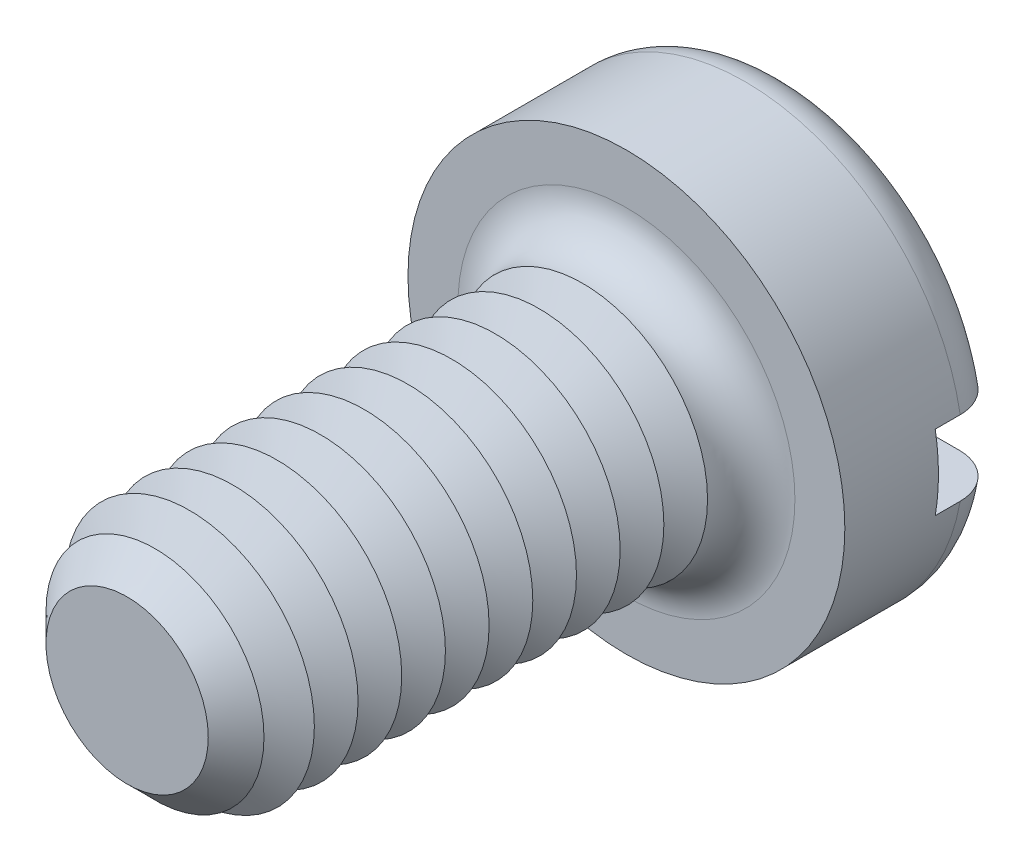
ISO-10303-21;
HEADER;
FILE_DESCRIPTION(('STEP AP214'),'2;1');
FILE_NAME('part.step','',(''),(''),'','','');
FILE_SCHEMA(('AUTOMOTIVE_DESIGN { 1 0 10303 214 1 1 1 1 }'));
ENDSEC;
DATA;
#1=APPLICATION_CONTEXT('core data for automotive mechanical design processes');
#2=APPLICATION_PROTOCOL_DEFINITION('international standard','automotive_design',2000,#1);
#3=PRODUCT_CONTEXT('',#1,'mechanical');
#4=PRODUCT('Part','Part','',(#3));
#5=PRODUCT_RELATED_PRODUCT_CATEGORY('part','',(#4));
#6=PRODUCT_DEFINITION_FORMATION('','',#4);
#7=PRODUCT_DEFINITION_CONTEXT('part definition',#1,'design');
#8=PRODUCT_DEFINITION('design','',#6,#7);
#9=PRODUCT_DEFINITION_SHAPE('','',#8);
#10=(LENGTH_UNIT() NAMED_UNIT(*) SI_UNIT(.MILLI.,.METRE.));
#11=(NAMED_UNIT(*) PLANE_ANGLE_UNIT() SI_UNIT($,.RADIAN.));
#12=(NAMED_UNIT(*) SI_UNIT($,.STERADIAN.) SOLID_ANGLE_UNIT());
#13=UNCERTAINTY_MEASURE_WITH_UNIT(LENGTH_MEASURE(1.E-05),#10,'distance_accuracy_value','');
#14=(GEOMETRIC_REPRESENTATION_CONTEXT(3) GLOBAL_UNCERTAINTY_ASSIGNED_CONTEXT((#13)) GLOBAL_UNIT_ASSIGNED_CONTEXT((#10,
#11,#12)) REPRESENTATION_CONTEXT('',''));
#15=CARTESIAN_POINT('',(0.,0.,0.));
#16=DIRECTION('',(0.,0.,1.));
#17=DIRECTION('',(1.,0.,0.));
#18=AXIS2_PLACEMENT_3D('',#15,#16,#17);
#19=CARTESIAN_POINT('',(0.,0.,-2.6));
#20=DIRECTION('',(0.,0.,1.));
#21=DIRECTION('',(1.,0.,0.));
#22=AXIS2_PLACEMENT_3D('',#19,#20,#21);
#23=PLANE('',#22);
#24=CARTESIAN_POINT('',(0.,0.,-2.6));
#25=DIRECTION('',(0.,0.,1.));
#26=DIRECTION('',(1.,0.,0.));
#27=AXIS2_PLACEMENT_3D('',#24,#25,#26);
#28=CIRCLE('',#27,2.8);
#29=CARTESIAN_POINT('',(-2.73495886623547,0.6,-2.6));
#30=VERTEX_POINT('',#29);
#31=CARTESIAN_POINT('',(2.73495886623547,0.6,-2.6));
#32=VERTEX_POINT('',#31);
#33=EDGE_CURVE('E116',#30,#32,#28,.F.);
#34=ORIENTED_EDGE('',*,*,#33,.T.);
#35=DIRECTION('',(1.,0.,0.));
#36=VECTOR('',#35,1.);
#37=CARTESIAN_POINT('',(-3.5,0.600000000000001,-2.6));
#38=LINE('',#37,#36);
#39=EDGE_CURVE('E111',#30,#32,#38,.T.);
#40=ORIENTED_EDGE('',*,*,#39,.F.);
#41=EDGE_LOOP('',(#34,#40));
#42=FACE_BOUND('',#41,.T.);
#43=ADVANCED_FACE('F39',(#42),#23,.F.);
#44=CARTESIAN_POINT('',(0.,0.,-1.9));
#45=DIRECTION('',(0.,0.,1.));
#46=DIRECTION('',(1.,0.,0.));
#47=AXIS2_PLACEMENT_3D('',#44,#45,#46);
#48=TOROIDAL_SURFACE('',#47,2.8,0.7);
#49=CARTESIAN_POINT('',(-3.24550494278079,0.600000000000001,-2.38938679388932));
#50=CARTESIAN_POINT('',(-3.21724139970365,0.600000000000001,-2.41780774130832));
#51=CARTESIAN_POINT('',(-3.18652103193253,0.600000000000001,-2.44383169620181));
#52=CARTESIAN_POINT('',(-3.12110229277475,0.600000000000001,-2.49034599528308));
#53=CARTESIAN_POINT('',(-3.08639834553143,0.6,-2.51082844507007));
#54=CARTESIAN_POINT('',(-3.01410013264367,0.6,-2.54568075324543));
#55=CARTESIAN_POINT('',(-2.97650963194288,0.6,-2.56005841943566));
#56=CARTESIAN_POINT('',(-2.89948250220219,0.6,-2.58239238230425));
#57=CARTESIAN_POINT('',(-2.86004633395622,0.6,-2.59035027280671));
#58=CARTESIAN_POINT('',(-2.77983715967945,0.6,-2.5997577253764));
#59=CARTESIAN_POINT('',(-2.73905311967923,0.6,-2.60111317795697));
#60=CARTESIAN_POINT('',(-2.65781876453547,0.6,-2.59706866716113));
#61=CARTESIAN_POINT('',(-2.61736849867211,0.6,-2.59166772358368));
#62=CARTESIAN_POINT('',(-2.53729983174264,0.6,-2.57414594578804));
#63=CARTESIAN_POINT('',(-2.49770360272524,0.6,-2.56192363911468));
#64=CARTESIAN_POINT('',(-2.421111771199,0.6,-2.5310238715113));
#65=CARTESIAN_POINT('',(-2.38411632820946,0.6,-2.51234601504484));
#66=CARTESIAN_POINT('',(-2.31371213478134,0.6,-2.46896762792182));
#67=CARTESIAN_POINT('',(-2.28031240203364,0.6,-2.44425244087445));
#68=CARTESIAN_POINT('',(-2.21823311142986,0.6,-2.38946667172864));
#69=CARTESIAN_POINT('',(-2.18955321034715,0.6,-2.35939647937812));
#70=CARTESIAN_POINT('',(-2.13836074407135,0.6,-2.29532787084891));
#71=CARTESIAN_POINT('',(-2.11574147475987,0.6,-2.26141482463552));
#72=CARTESIAN_POINT('',(-2.07677080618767,0.6,-2.19015935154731));
#73=CARTESIAN_POINT('',(-2.06041784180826,0.6,-2.15281778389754));
#74=CARTESIAN_POINT('',(-2.03508596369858,0.6,-2.07723332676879));
#75=CARTESIAN_POINT('',(-2.02585871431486,0.6,-2.03907365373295));
#76=CARTESIAN_POINT('',(-2.01416722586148,0.6,-1.96173417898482));
#77=CARTESIAN_POINT('',(-2.01170151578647,0.6,-1.92255460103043));
#78=CARTESIAN_POINT('',(-2.01359934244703,0.6,-1.84555709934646));
#79=CARTESIAN_POINT('',(-2.01775787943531,0.6,-1.80773393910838));
#80=CARTESIAN_POINT('',(-2.03236373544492,0.6,-1.73332511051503));
#81=CARTESIAN_POINT('',(-2.04281097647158,0.6,-1.69673942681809));
#82=CARTESIAN_POINT('',(-2.06962963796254,0.6,-1.62577336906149));
#83=CARTESIAN_POINT('',(-2.08600685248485,0.6,-1.59139519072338));
#84=CARTESIAN_POINT('',(-2.12413495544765,0.6,-1.52576356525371));
#85=CARTESIAN_POINT('',(-2.14588657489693,0.6,-1.49451054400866));
#86=CARTESIAN_POINT('',(-2.19483541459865,0.6,-1.43498643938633));
#87=CARTESIAN_POINT('',(-2.22217844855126,0.6,-1.40683532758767));
#88=CARTESIAN_POINT('',(-2.28105616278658,0.6,-1.35532544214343));
#89=CARTESIAN_POINT('',(-2.3125916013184,0.6,-1.33196753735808));
#90=CARTESIAN_POINT('',(-2.38018779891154,0.6,-1.28984356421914));
#91=CARTESIAN_POINT('',(-2.41637068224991,0.6,-1.27127330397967));
#92=CARTESIAN_POINT('',(-2.49129688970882,0.6,-1.24032971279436));
#93=CARTESIAN_POINT('',(-2.53004053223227,0.6,-1.22795715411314));
#94=CARTESIAN_POINT('',(-2.6098393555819,0.6,-1.2095515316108));
#95=CARTESIAN_POINT('',(-2.65092550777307,0.6,-1.20365237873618));
#96=CARTESIAN_POINT('',(-2.7335069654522,0.6,-1.1988380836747));
#97=CARTESIAN_POINT('',(-2.7750022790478,0.6,-1.19992308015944));
#98=CARTESIAN_POINT('',(-2.85718851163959,0.6,-1.20909046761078));
#99=CARTESIAN_POINT('',(-2.8978799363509,0.6,-1.21716830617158));
#100=CARTESIAN_POINT('',(-2.97729176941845,0.6,-1.24014327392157));
#101=CARTESIAN_POINT('',(-3.01601231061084,0.6,-1.25503994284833));
#102=CARTESIAN_POINT('',(-3.08976822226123,0.6,-1.29101066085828));
#103=CARTESIAN_POINT('',(-3.12484927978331,0.600000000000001,-1.31199098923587));
#104=CARTESIAN_POINT('',(-3.19090022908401,0.600000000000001,-1.35965144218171));
#105=CARTESIAN_POINT('',(-3.22187053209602,0.600000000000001,-1.38633099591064));
#106=CARTESIAN_POINT('',(-3.2781946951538,0.600000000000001,-1.44408564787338));
#107=CARTESIAN_POINT('',(-3.3036441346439,0.600000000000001,-1.47506754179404));
#108=CARTESIAN_POINT('',(-3.34887649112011,0.600000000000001,-1.54092398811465));
#109=CARTESIAN_POINT('',(-3.36865993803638,0.600000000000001,-1.57579817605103));
#110=CARTESIAN_POINT('',(-3.40166738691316,0.600000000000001,-1.64783067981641));
#111=CARTESIAN_POINT('',(-3.41499360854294,0.600000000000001,-1.68494217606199));
#112=CARTESIAN_POINT('',(-3.43515375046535,0.600000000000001,-1.76088675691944));
#113=CARTESIAN_POINT('',(-3.44198836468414,0.600000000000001,-1.79971965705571));
#114=CARTESIAN_POINT('',(-3.44891916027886,0.600000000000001,-1.87757893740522));
#115=CARTESIAN_POINT('',(-3.44908375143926,0.600000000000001,-1.91659924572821));
#116=CARTESIAN_POINT('',(-3.44284111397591,0.600000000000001,-1.99412088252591));
#117=CARTESIAN_POINT('',(-3.43643236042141,0.600000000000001,-2.03262208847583));
#118=CARTESIAN_POINT('',(-3.41725803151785,0.600000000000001,-2.10792315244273));
#119=CARTESIAN_POINT('',(-3.40450469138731,0.600000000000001,-2.14472613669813));
#120=CARTESIAN_POINT('',(-3.3730385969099,0.600000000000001,-2.21565060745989));
#121=CARTESIAN_POINT('',(-3.35433321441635,0.600000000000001,-2.24977534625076));
#122=CARTESIAN_POINT('',(-3.3201892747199,0.600000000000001,-2.30136364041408));
#123=CARTESIAN_POINT('',(-3.30647805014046,0.600000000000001,-2.31999402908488));
#124=CARTESIAN_POINT('',(-3.27728518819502,0.600000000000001,-2.35581090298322));
#125=CARTESIAN_POINT('',(-3.26180356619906,0.600000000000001,-2.37299740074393));
#126=CARTESIAN_POINT('',(-3.24550494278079,0.600000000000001,-2.38938679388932));
#127=B_SPLINE_CURVE_WITH_KNOTS('',3,(#49,#50,#51,#52,#53,#54,#55,#56,#57,#58,#59,#60,#61,#62,
#63,#64,#65,#66,#67,#68,#69,#70,#71,#72,#73,#74,#75,#76,#77,#78,#79,#80,#81,#82,#83,#84,#85,#86,
#87,#88,#89,#90,#91,#92,#93,#94,#95,#96,#97,#98,#99,#100,#101,#102,#103,#104,#105,#106,#107,
#108,#109,#110,#111,#112,#113,#114,#115,#116,#117,#118,#119,#120,#121,#122,#123,#124,#125,#126),
.UNSPECIFIED.,.T.,.F.,(4,2,2,2,2,2,2,2,2,2,2,2,2,2,2,2,2,2,2,2,2,2,2,2,2,2,2,2,2,2,2,2,2,2,2,2,
2,2,4),(0.,0.120160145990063,0.240490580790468,0.36066665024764,0.480812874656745,
0.602666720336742,0.724538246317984,0.848272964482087,0.972015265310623,1.09606100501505,
1.2200977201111,1.34178071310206,1.46343329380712,1.58062647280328,1.6977941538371,
1.81140573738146,1.92501591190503,2.03873739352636,2.15247435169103,2.26967910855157,
2.38690509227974,2.50835551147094,2.62982106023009,2.75375450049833,2.87769040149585,
3.00154567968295,3.12539259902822,3.24742469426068,3.36944457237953,3.48914477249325,
3.60883377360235,3.72656056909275,3.84427477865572,3.96078136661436,4.07731498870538,
4.19362474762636,4.3097910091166,4.37908387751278,4.44837614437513),.UNSPECIFIED.);
#128=CARTESIAN_POINT('',(-3.44818792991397,0.600000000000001,-1.8999999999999));
#129=VERTEX_POINT('',#128);
#130=EDGE_CURVE('E265',#129,#30,#127,.T.);
#131=ORIENTED_EDGE('',*,*,#130,.F.);
#132=CARTESIAN_POINT('',(0.,0.,-1.9));
#133=DIRECTION('',(0.,0.,1.));
#134=DIRECTION('',(1.,0.,0.));
#135=AXIS2_PLACEMENT_3D('',#132,#133,#134);
#136=CIRCLE('',#135,3.5);
#137=CARTESIAN_POINT('',(3.44818792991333,0.6,-1.9));
#138=VERTEX_POINT('',#137);
#139=EDGE_CURVE('E125',#138,#129,#136,.T.);
#140=ORIENTED_EDGE('',*,*,#139,.F.);
#141=CARTESIAN_POINT('',(2.1414268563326,0.6,-2.29762171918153));
#142=CARTESIAN_POINT('',(2.16505443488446,0.6,-2.33058245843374));
#143=CARTESIAN_POINT('',(2.19155609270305,0.6,-2.36152717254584));
#144=CARTESIAN_POINT('',(2.24942944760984,0.6,-2.41852964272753));
#145=CARTESIAN_POINT('',(2.28080921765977,0.6,-2.44457913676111));
#146=CARTESIAN_POINT('',(2.34741203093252,0.6,-2.49105381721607));
#147=CARTESIAN_POINT('',(2.38262862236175,0.6,-2.51148824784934));
#148=CARTESIAN_POINT('',(2.45593176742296,0.6,-2.54626881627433));
#149=CARTESIAN_POINT('',(2.49401741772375,0.6,-2.56061686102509));
#150=CARTESIAN_POINT('',(2.57272605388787,0.6,-2.58306429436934));
#151=CARTESIAN_POINT('',(2.6133821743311,0.6,-2.59104769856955));
#152=CARTESIAN_POINT('',(2.6954618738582,0.6,-2.60009608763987));
#153=CARTESIAN_POINT('',(2.73688552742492,0.6,-2.60116039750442));
#154=CARTESIAN_POINT('',(2.81941950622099,0.6,-2.5962925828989));
#155=CARTESIAN_POINT('',(2.86052888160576,0.6,-2.59034422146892));
#156=CARTESIAN_POINT('',(2.94113709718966,0.6,-2.57153687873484));
#157=CARTESIAN_POINT('',(2.98063603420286,0.6,-2.55867831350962));
#158=CARTESIAN_POINT('',(3.05633735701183,0.6,-2.52657771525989));
#159=CARTESIAN_POINT('',(3.09257627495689,0.6,-2.50742188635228));
#160=CARTESIAN_POINT('',(3.16123898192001,0.6,-2.46318606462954));
#161=CARTESIAN_POINT('',(3.19366316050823,0.6,-2.4381066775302));
#162=CARTESIAN_POINT('',(3.25312278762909,0.6,-2.38324481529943));
#163=CARTESIAN_POINT('',(3.28024842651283,0.6,-2.35356008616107));
#164=CARTESIAN_POINT('',(3.32902587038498,0.6,-2.28998971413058));
#165=CARTESIAN_POINT('',(3.35067820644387,0.6,-2.25610447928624));
#166=CARTESIAN_POINT('',(3.38751207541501,0.6,-2.18572286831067));
#167=CARTESIAN_POINT('',(3.40279804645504,0.6,-2.14928112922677));
#168=CARTESIAN_POINT('',(3.42695590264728,0.6,-2.07433042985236));
#169=CARTESIAN_POINT('',(3.43582824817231,0.6,-2.03582161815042));
#170=CARTESIAN_POINT('',(3.44682113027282,0.6,-1.95829536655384));
#171=CARTESIAN_POINT('',(3.44901648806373,0.6,-1.91928851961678));
#172=CARTESIAN_POINT('',(3.44680085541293,0.6,-1.84146366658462));
#173=CARTESIAN_POINT('',(3.44239008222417,0.6,-1.80264565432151));
#174=CARTESIAN_POINT('',(3.42712544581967,0.6,-1.72644634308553));
#175=CARTESIAN_POINT('',(3.41629508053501,0.6,-1.6890603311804));
#176=CARTESIAN_POINT('',(3.38853757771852,0.6,-1.61662604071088));
#177=CARTESIAN_POINT('',(3.37161039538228,0.6,-1.58157777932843));
#178=CARTESIAN_POINT('',(3.33207798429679,0.6,-1.51464178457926));
#179=CARTESIAN_POINT('',(3.30944854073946,0.6,-1.48276835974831));
#180=CARTESIAN_POINT('',(3.2592165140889,0.6,-1.42321861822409));
#181=CARTESIAN_POINT('',(3.23161370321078,0.6,-1.3955424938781));
#182=CARTESIAN_POINT('',(3.17188519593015,0.6,-1.34481834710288));
#183=CARTESIAN_POINT('',(3.13971065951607,0.6,-1.32182785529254));
#184=CARTESIAN_POINT('',(3.07201123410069,0.6,-1.28147003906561));
#185=CARTESIAN_POINT('',(3.03648608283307,0.6,-1.26410315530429));
#186=CARTESIAN_POINT('',(2.962449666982,0.6,-1.2351645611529));
#187=CARTESIAN_POINT('',(2.92389781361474,0.6,-1.22369671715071));
#188=CARTESIAN_POINT('',(2.84543273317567,0.6,-1.20726565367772));
#189=CARTESIAN_POINT('',(2.80551936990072,0.6,-1.20230308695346));
#190=CARTESIAN_POINT('',(2.72467191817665,0.6,-1.1989357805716));
#191=CARTESIAN_POINT('',(2.68373266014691,0.6,-1.20065484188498));
#192=CARTESIAN_POINT('',(2.60270222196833,0.6,-1.21084560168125));
#193=CARTESIAN_POINT('',(2.56261112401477,0.6,-1.21931795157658));
#194=CARTESIAN_POINT('',(2.48385954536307,0.6,-1.24292934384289));
#195=CARTESIAN_POINT('',(2.44522508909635,0.6,-1.25815531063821));
#196=CARTESIAN_POINT('',(2.37106165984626,0.6,-1.29488663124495));
#197=CARTESIAN_POINT('',(2.33553282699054,0.6,-1.31639226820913));
#198=CARTESIAN_POINT('',(2.2686996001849,0.6,-1.36507949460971));
#199=CARTESIAN_POINT('',(2.23738745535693,0.6,-1.39225042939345));
#200=CARTESIAN_POINT('',(2.17990424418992,0.6,-1.45157941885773));
#201=CARTESIAN_POINT('',(2.15373259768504,0.6,-1.48373691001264));
#202=CARTESIAN_POINT('',(2.10799355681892,0.6,-1.551327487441));
#203=CARTESIAN_POINT('',(2.08828258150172,0.6,-1.58666329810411));
#204=CARTESIAN_POINT('',(2.05534440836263,0.6,-1.66023600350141));
#205=CARTESIAN_POINT('',(2.042115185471,0.6,-1.6984719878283));
#206=CARTESIAN_POINT('',(2.02303126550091,0.6,-1.77519783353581));
#207=CARTESIAN_POINT('',(2.01691541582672,0.6,-1.8136228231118));
#208=CARTESIAN_POINT('',(2.01140375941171,0.6,-1.89096056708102));
#209=CARTESIAN_POINT('',(2.01200856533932,0.6,-1.92987336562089));
#210=CARTESIAN_POINT('',(2.01981617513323,0.6,-2.006065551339));
#211=CARTESIAN_POINT('',(2.02685835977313,0.6,-2.04336165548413));
#212=CARTESIAN_POINT('',(2.0470502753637,0.6,-2.1162250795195));
#213=CARTESIAN_POINT('',(2.06019252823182,0.6,-2.15179445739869));
#214=CARTESIAN_POINT('',(2.08525738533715,0.6,-2.20558874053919));
#215=CARTESIAN_POINT('',(2.09529161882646,0.6,-2.22471751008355));
#216=CARTESIAN_POINT('',(2.11708813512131,0.6,-2.26196179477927));
#217=CARTESIAN_POINT('',(2.12885034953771,0.6,-2.28007734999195));
#218=CARTESIAN_POINT('',(2.1414268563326,0.6,-2.29762171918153));
#219=B_SPLINE_CURVE_WITH_KNOTS('',3,(#141,#142,#143,#144,#145,#146,#147,#148,#149,#150,#151,
#152,#153,#154,#155,#156,#157,#158,#159,#160,#161,#162,#163,#164,#165,#166,#167,#168,#169,#170,
#171,#172,#173,#174,#175,#176,#177,#178,#179,#180,#181,#182,#183,#184,#185,#186,#187,#188,#189,
#190,#191,#192,#193,#194,#195,#196,#197,#198,#199,#200,#201,#202,#203,#204,#205,#206,#207,#208,
#209,#210,#211,#212,#213,#214,#215,#216,#217,#218),.UNSPECIFIED.,.T.,.F.,(4,2,2,2,2,2,2,2,2,2,2,
2,2,2,2,2,2,2,2,2,2,2,2,2,2,2,2,2,2,2,2,2,2,2,2,2,2,2,4),(0.,0.121582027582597,
0.243367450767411,0.364951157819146,0.486496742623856,0.610209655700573,0.733934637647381,
0.857946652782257,0.981951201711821,1.1043243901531,1.22668507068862,1.34673532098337,
1.46677391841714,1.58475736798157,1.70273234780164,1.81938035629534,1.93602452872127,
2.05224435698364,2.168465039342,2.28518782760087,2.40191596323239,2.52000081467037,
2.63809491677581,2.75820270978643,2.87832255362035,3.00067856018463,3.1230463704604,
3.24703703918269,3.37103329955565,3.49479843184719,3.6185495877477,3.73932715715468,
3.86006696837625,3.9762182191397,4.09238005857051,4.2057203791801,4.31892212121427,
4.38364046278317,4.44835624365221),.UNSPECIFIED.);
#220=EDGE_CURVE('E267',#32,#138,#219,.T.);
#221=ORIENTED_EDGE('',*,*,#220,.F.);
#222=ORIENTED_EDGE('',*,*,#33,.F.);
#223=EDGE_LOOP('',(#131,#140,#221,#222));
#224=FACE_BOUND('',#223,.T.);
#225=ADVANCED_FACE('F249',(#224),#48,.T.);
#226=CARTESIAN_POINT('',(0.,0.,-2.6));
#227=DIRECTION('',(0.,0.,1.));
#228=DIRECTION('',(1.,0.,0.));
#229=AXIS2_PLACEMENT_3D('',#226,#227,#228);
#230=CYLINDRICAL_SURFACE('',#229,3.5);
#231=DIRECTION('',(0.,0.,1.));
#232=VECTOR('',#231,1.);
#233=CARTESIAN_POINT('',(3.44818792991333,0.6,-2.6));
#234=LINE('',#233,#232);
#235=CARTESIAN_POINT('',(3.44818792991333,0.6,-1.5));
#236=VERTEX_POINT('',#235);
#237=EDGE_CURVE('E282',#138,#236,#234,.T.);
#238=ORIENTED_EDGE('',*,*,#237,.F.);
#239=ORIENTED_EDGE('',*,*,#139,.T.);
#240=DIRECTION('',(0.,0.,1.));
#241=VECTOR('',#240,1.);
#242=CARTESIAN_POINT('',(-3.44818792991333,0.600000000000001,-2.6));
#243=LINE('',#242,#241);
#244=CARTESIAN_POINT('',(-3.44818792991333,0.600000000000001,-1.5));
#245=VERTEX_POINT('',#244);
#246=EDGE_CURVE('E63',#245,#129,#243,.F.);
#247=ORIENTED_EDGE('',*,*,#246,.F.);
#248=CARTESIAN_POINT('',(0.,0.,-1.5));
#249=DIRECTION('',(0.,0.,-1.));
#250=DIRECTION('',(-1.,0.,0.));
#251=AXIS2_PLACEMENT_3D('',#248,#249,#250);
#252=CIRCLE('',#251,3.5);
#253=CARTESIAN_POINT('',(-3.44818792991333,-0.599999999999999,-1.5));
#254=VERTEX_POINT('',#253);
#255=EDGE_CURVE('E43',#245,#254,#252,.F.);
#256=ORIENTED_EDGE('',*,*,#255,.T.);
#257=DIRECTION('',(0.,0.,1.));
#258=VECTOR('',#257,1.);
#259=CARTESIAN_POINT('',(-3.44818792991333,-0.599999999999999,-2.6));
#260=LINE('',#259,#258);
#261=CARTESIAN_POINT('',(-3.44818792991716,-0.599999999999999,-1.90000000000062));
#262=VERTEX_POINT('',#261);
#263=EDGE_CURVE('E280',#262,#254,#260,.T.);
#264=ORIENTED_EDGE('',*,*,#263,.F.);
#265=CARTESIAN_POINT('',(3.44818792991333,-0.6,-1.9));
#266=VERTEX_POINT('',#265);
#267=EDGE_CURVE('E127',#262,#266,#136,.T.);
#268=ORIENTED_EDGE('',*,*,#267,.T.);
#269=DIRECTION('',(0.,0.,1.));
#270=VECTOR('',#269,1.);
#271=CARTESIAN_POINT('',(3.44818792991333,-0.6,-2.6));
#272=LINE('',#271,#270);
#273=CARTESIAN_POINT('',(3.44818792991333,-0.6,-1.5));
#274=VERTEX_POINT('',#273);
#275=EDGE_CURVE('E55',#274,#266,#272,.F.);
#276=ORIENTED_EDGE('',*,*,#275,.F.);
#277=EDGE_CURVE('E11',#274,#236,#252,.F.);
#278=ORIENTED_EDGE('',*,*,#277,.T.);
#279=EDGE_LOOP('',(#238,#239,#247,#256,#264,#268,#276,#278));
#280=FACE_BOUND('',#279,.T.);
#281=CARTESIAN_POINT('',(0.,0.,0.));
#282=DIRECTION('',(0.,0.,1.));
#283=DIRECTION('',(1.,0.,0.));
#284=AXIS2_PLACEMENT_3D('',#281,#282,#283);
#285=CIRCLE('',#284,3.5);
#286=CARTESIAN_POINT('',(3.5,0.,0.));
#287=VERTEX_POINT('',#286);
#288=EDGE_CURVE('E285',#287,#287,#285,.T.);
#289=ORIENTED_EDGE('',*,*,#288,.F.);
#290=EDGE_LOOP('',(#289));
#291=FACE_BOUND('',#290,.T.);
#292=ADVANCED_FACE('F245',(#280,#291),#230,.T.);
#293=CARTESIAN_POINT('',(2.73495886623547,-0.6,-2.6));
#294=VERTEX_POINT('',#293);
#295=CARTESIAN_POINT('',(-2.73495886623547,-0.6,-2.6));
#296=VERTEX_POINT('',#295);
#297=EDGE_CURVE('E109',#294,#296,#28,.F.);
#298=ORIENTED_EDGE('',*,*,#297,.T.);
#299=DIRECTION('',(-1.,0.,0.));
#300=VECTOR('',#299,1.);
#301=CARTESIAN_POINT('',(-3.5,-0.599999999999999,-2.6));
#302=LINE('',#301,#300);
#303=EDGE_CURVE('E96',#294,#296,#302,.T.);
#304=ORIENTED_EDGE('',*,*,#303,.F.);
#305=EDGE_LOOP('',(#298,#304));
#306=FACE_BOUND('',#305,.T.);
#307=ADVANCED_FACE('F108',(#306),#23,.F.);
#308=CARTESIAN_POINT('',(0.,0.,0.));
#309=DIRECTION('',(0.,0.,1.));
#310=DIRECTION('',(1.,0.,0.));
#311=AXIS2_PLACEMENT_3D('',#308,#309,#310);
#312=PLANE('',#311);
#313=CARTESIAN_POINT('',(0.,0.,0.));
#314=DIRECTION('',(0.,0.,1.));
#315=DIRECTION('',(1.,0.,0.));
#316=AXIS2_PLACEMENT_3D('',#313,#314,#315);
#317=CIRCLE('',#316,2.7);
#318=CARTESIAN_POINT('',(2.7,0.,0.));
#319=VERTEX_POINT('',#318);
#320=EDGE_CURVE('E115',#319,#319,#317,.F.);
#321=ORIENTED_EDGE('',*,*,#320,.T.);
#322=EDGE_LOOP('',(#321));
#323=FACE_BOUND('',#322,.T.);
#324=ORIENTED_EDGE('',*,*,#288,.T.);
#325=EDGE_LOOP('',(#324));
#326=FACE_BOUND('',#325,.T.);
#327=ADVANCED_FACE('F244',(#323,#326),#312,.T.);
#328=CARTESIAN_POINT('',(-3.24550494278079,-0.599999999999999,-2.38938679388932));
#329=CARTESIAN_POINT('',(-3.27309693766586,-0.599999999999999,-2.36163611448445));
#330=CARTESIAN_POINT('',(-3.29838741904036,-0.599999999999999,-2.3315608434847));
#331=CARTESIAN_POINT('',(-3.34359429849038,-0.599999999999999,-2.26757659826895));
#332=CARTESIAN_POINT('',(-3.36350518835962,-0.599999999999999,-2.23366374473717));
#333=CARTESIAN_POINT('',(-3.39733065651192,-0.599999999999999,-2.16296274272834));
#334=CARTESIAN_POINT('',(-3.4112451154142,-0.599999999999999,-2.12617453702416));
#335=CARTESIAN_POINT('',(-3.43264462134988,-0.599999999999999,-2.05078178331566));
#336=CARTESIAN_POINT('',(-3.44013114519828,-0.599999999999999,-2.01217765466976));
#337=CARTESIAN_POINT('',(-3.44841975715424,-0.599999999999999,-1.9345391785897));
#338=CARTESIAN_POINT('',(-3.44926944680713,-0.599999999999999,-1.89550990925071));
#339=CARTESIAN_POINT('',(-3.44438358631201,-0.599999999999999,-1.81786552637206));
#340=CARTESIAN_POINT('',(-3.43864801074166,-0.599999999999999,-1.77925041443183));
#341=CARTESIAN_POINT('',(-3.42079221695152,-0.599999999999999,-1.70364264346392));
#342=CARTESIAN_POINT('',(-3.40869011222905,-0.599999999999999,-1.66664570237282));
#343=CARTESIAN_POINT('',(-3.37847692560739,-0.599999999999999,-1.59519424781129));
#344=CARTESIAN_POINT('',(-3.3603657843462,-0.599999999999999,-1.56073975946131));
#345=CARTESIAN_POINT('',(-3.31856549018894,-0.599999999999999,-1.4951524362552));
#346=CARTESIAN_POINT('',(-3.29484830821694,-0.599999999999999,-1.46403747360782));
#347=CARTESIAN_POINT('',(-3.24258489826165,-0.599999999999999,-1.40617131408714));
#348=CARTESIAN_POINT('',(-3.21403843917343,-0.599999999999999,-1.37942032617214));
#349=CARTESIAN_POINT('',(-3.15256084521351,-0.599999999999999,-1.33067963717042));
#350=CARTESIAN_POINT('',(-3.11958015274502,-0.599999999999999,-1.30875246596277));
#351=CARTESIAN_POINT('',(-3.0504559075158,-0.599999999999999,-1.27063718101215));
#352=CARTESIAN_POINT('',(-3.01431209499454,-0.6,-1.25444953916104));
#353=CARTESIAN_POINT('',(-2.93921710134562,-0.6,-1.22796796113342));
#354=CARTESIAN_POINT('',(-2.90022796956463,-0.6,-1.217781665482));
#355=CARTESIAN_POINT('',(-2.82110512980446,-0.6,-1.20396915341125));
#356=CARTESIAN_POINT('',(-2.7809713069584,-0.6,-1.2003435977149));
#357=CARTESIAN_POINT('',(-2.69990924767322,-0.6,-1.19969717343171));
#358=CARTESIAN_POINT('',(-2.65898001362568,-0.6,-1.20279937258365));
#359=CARTESIAN_POINT('',(-2.57819986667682,-0.6,-1.21574287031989));
#360=CARTESIAN_POINT('',(-2.53834905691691,-0.6,-1.22558481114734));
#361=CARTESIAN_POINT('',(-2.46035232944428,-0.6,-1.25189361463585));
#362=CARTESIAN_POINT('',(-2.42223314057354,-0.6,-1.2684398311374));
#363=CARTESIAN_POINT('',(-2.34932316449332,-0.6,-1.30771928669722));
#364=CARTESIAN_POINT('',(-2.31453248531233,-0.6,-1.33045272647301));
#365=CARTESIAN_POINT('',(-2.24945577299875,-0.6,-1.38141543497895));
#366=CARTESIAN_POINT('',(-2.21915255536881,-0.6,-1.40962272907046));
#367=CARTESIAN_POINT('',(-2.16386461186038,-0.6,-1.47084552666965));
#368=CARTESIAN_POINT('',(-2.13887916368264,-0.6,-1.50386037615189));
#369=CARTESIAN_POINT('',(-2.09568071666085,-0.6,-1.57285917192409));
#370=CARTESIAN_POINT('',(-2.07730739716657,-0.6,-1.60874263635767));
#371=CARTESIAN_POINT('',(-2.04712019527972,-0.6,-1.68316975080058));
#372=CARTESIAN_POINT('',(-2.03530452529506,-0.6,-1.72171267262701));
#373=CARTESIAN_POINT('',(-2.01901751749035,-0.6,-1.79878952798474));
#374=CARTESIAN_POINT('',(-2.01428434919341,-0.6,-1.8372682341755));
#375=CARTESIAN_POINT('',(-2.01150652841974,-0.6,-1.91446369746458));
#376=CARTESIAN_POINT('',(-2.01346084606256,-0.6,-1.95318041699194));
#377=CARTESIAN_POINT('',(-2.02386268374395,-0.6,-2.0288619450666));
#378=CARTESIAN_POINT('',(-2.03216724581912,-0.6,-2.06584654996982));
#379=CARTESIAN_POINT('',(-2.05479337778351,-0.6,-2.13792373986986));
#380=CARTESIAN_POINT('',(-2.06911522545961,-0.6,-2.1730162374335));
#381=CARTESIAN_POINT('',(-2.10349906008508,-0.6,-2.24081034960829));
#382=CARTESIAN_POINT('',(-2.12363007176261,-0.6,-2.27347689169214));
#383=CARTESIAN_POINT('',(-2.16891308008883,-0.6,-2.33511902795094));
#384=CARTESIAN_POINT('',(-2.19406590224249,-0.6,-2.36409401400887));
#385=CARTESIAN_POINT('',(-2.24962389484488,-0.6,-2.41861972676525));
#386=CARTESIAN_POINT('',(-2.28018314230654,-0.6,-2.44401345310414));
#387=CARTESIAN_POINT('',(-2.34501720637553,-0.6,-2.48950558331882));
#388=CARTESIAN_POINT('',(-2.37929266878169,-0.6,-2.50960306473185));
#389=CARTESIAN_POINT('',(-2.45179417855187,-0.6,-2.54458276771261));
#390=CARTESIAN_POINT('',(-2.49011248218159,-0.6,-2.55927401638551));
#391=CARTESIAN_POINT('',(-2.56865227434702,-0.6,-2.58211133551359));
#392=CARTESIAN_POINT('',(-2.60887386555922,-0.6,-2.59025705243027));
#393=CARTESIAN_POINT('',(-2.69064746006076,-0.6,-2.59982905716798));
#394=CARTESIAN_POINT('',(-2.73220999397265,-0.6,-2.60116580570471));
#395=CARTESIAN_POINT('',(-2.81497658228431,-0.6,-2.59679700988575));
#396=CARTESIAN_POINT('',(-2.85618055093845,-0.6,-2.59108982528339));
#397=CARTESIAN_POINT('',(-2.93677683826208,-0.6,-2.57279487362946));
#398=CARTESIAN_POINT('',(-2.97617834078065,-0.6,-2.56024753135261));
#399=CARTESIAN_POINT('',(-3.05222242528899,-0.6,-2.52860709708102));
#400=CARTESIAN_POINT('',(-3.08886850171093,-0.599999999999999,-2.50952247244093));
#401=CARTESIAN_POINT('',(-3.14562501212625,-0.599999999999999,-2.47340693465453));
#402=CARTESIAN_POINT('',(-3.16689358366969,-0.599999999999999,-2.45816337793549));
#403=CARTESIAN_POINT('',(-3.20761866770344,-0.599999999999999,-2.42542115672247));
#404=CARTESIAN_POINT('',(-3.22707520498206,-0.599999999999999,-2.40792252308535));
#405=CARTESIAN_POINT('',(-3.24550494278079,-0.599999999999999,-2.38938679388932));
#406=B_SPLINE_CURVE_WITH_KNOTS('',3,(#328,#329,#330,#331,#332,#333,#334,#335,#336,#337,#338,
#339,#340,#341,#342,#343,#344,#345,#346,#347,#348,#349,#350,#351,#352,#353,#354,#355,#356,#357,
#358,#359,#360,#361,#362,#363,#364,#365,#366,#367,#368,#369,#370,#371,#372,#373,#374,#375,#376,
#377,#378,#379,#380,#381,#382,#383,#384,#385,#386,#387,#388,#389,#390,#391,#392,#393,#394,#395,
#396,#397,#398,#399,#400,#401,#402,#403,#404,#405),.UNSPECIFIED.,.T.,.F.,(4,2,2,2,2,2,2,2,2,2,2,
2,2,2,2,2,2,2,2,2,2,2,2,2,2,2,2,2,2,2,2,2,2,2,2,2,2,2,4),(0.,0.117306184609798,
0.234732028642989,0.352160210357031,0.469561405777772,0.586119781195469,0.702678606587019,
0.818907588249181,0.935137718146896,1.05196174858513,1.1687913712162,1.2870562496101,
1.40533084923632,1.52566688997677,1.64601504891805,1.76858322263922,1.89116307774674,
2.01523830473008,2.13931755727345,2.26290863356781,2.38648291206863,2.50681878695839,
2.62712184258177,2.74285697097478,2.85857427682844,2.97176054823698,3.08495204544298,
3.19954814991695,3.31416310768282,3.43282436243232,3.55150627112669,3.67404987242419,
3.79660009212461,3.92075778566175,4.04494439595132,4.16840490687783,4.29170610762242,
4.3700604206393,4.44841366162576),.UNSPECIFIED.);
#407=EDGE_CURVE('E103',#296,#262,#406,.T.);
#408=ORIENTED_EDGE('',*,*,#407,.F.);
#409=ORIENTED_EDGE('',*,*,#297,.F.);
#410=CARTESIAN_POINT('',(2.1414268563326,-0.6,-2.29762171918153));
#411=CARTESIAN_POINT('',(2.11900044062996,-0.6,-2.26633119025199));
#412=CARTESIAN_POINT('',(2.09913154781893,-0.6,-2.23318080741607));
#413=CARTESIAN_POINT('',(2.06517900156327,-0.6,-2.16401111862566));
#414=CARTESIAN_POINT('',(2.05109968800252,-0.6,-2.12798968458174));
#415=CARTESIAN_POINT('',(2.02923593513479,-0.6,-2.05404277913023));
#416=CARTESIAN_POINT('',(2.02145692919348,-0.6,-2.01611569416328));
#417=CARTESIAN_POINT('',(2.01251710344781,-0.6,-1.93949649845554));
#418=CARTESIAN_POINT('',(2.01135461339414,-0.6,-1.90080458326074));
#419=CARTESIAN_POINT('',(2.01564803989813,-0.6,-1.82450508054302));
#420=CARTESIAN_POINT('',(2.02098305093,-0.6,-1.78689061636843));
#421=CARTESIAN_POINT('',(2.03786826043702,-0.6,-1.71308589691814));
#422=CARTESIAN_POINT('',(2.04941870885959,-0.6,-1.67689569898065));
#423=CARTESIAN_POINT('',(2.07838664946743,-0.6,-1.60676639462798));
#424=CARTESIAN_POINT('',(2.09582944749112,-0.6,-1.57283776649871));
#425=CARTESIAN_POINT('',(2.1359925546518,-0.6,-1.50826612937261));
#426=CARTESIAN_POINT('',(2.15871360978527,-0.6,-1.47762358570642));
#427=CARTESIAN_POINT('',(2.20955413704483,-0.6,-1.41943384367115));
#428=CARTESIAN_POINT('',(2.23782364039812,-0.6,-1.39201777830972));
#429=CARTESIAN_POINT('',(2.29842612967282,-0.6,-1.34212199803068));
#430=CARTESIAN_POINT('',(2.33075984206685,-0.6,-1.31964316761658));
#431=CARTESIAN_POINT('',(2.399806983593,-0.6,-1.27945238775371));
#432=CARTESIAN_POINT('',(2.43663466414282,-0.6,-1.26193653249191));
#433=CARTESIAN_POINT('',(2.51267241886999,-0.6,-1.23320660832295));
#434=CARTESIAN_POINT('',(2.55188277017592,-0.6,-1.22199327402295));
#435=CARTESIAN_POINT('',(2.63235000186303,-0.6,-1.20602688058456));
#436=CARTESIAN_POINT('',(2.673631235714,-0.6,-1.20139617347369));
#437=CARTESIAN_POINT('',(2.7563863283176,-0.6,-1.19914622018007));
#438=CARTESIAN_POINT('',(2.79786018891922,-0.6,-1.20152704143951));
#439=CARTESIAN_POINT('',(2.87971192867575,-0.6,-1.21326884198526));
#440=CARTESIAN_POINT('',(2.92009214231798,-0.6,-1.22261349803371));
#441=CARTESIAN_POINT('',(2.99866777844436,-0.6,-1.24805614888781));
#442=CARTESIAN_POINT('',(3.03686335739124,-0.6,-1.26415365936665));
#443=CARTESIAN_POINT('',(3.10934738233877,-0.6,-1.3023912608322));
#444=CARTESIAN_POINT('',(3.14368704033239,-0.6,-1.32443423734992));
#445=CARTESIAN_POINT('',(3.20808395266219,-0.6,-1.37407725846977));
#446=CARTESIAN_POINT('',(3.23814164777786,-0.6,-1.40167673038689));
#447=CARTESIAN_POINT('',(3.29251534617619,-0.6,-1.46108303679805));
#448=CARTESIAN_POINT('',(3.3169296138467,-0.6,-1.49279994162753));
#449=CARTESIAN_POINT('',(3.35998418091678,-0.6,-1.55993706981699));
#450=CARTESIAN_POINT('',(3.37862502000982,-0.6,-1.59535694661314));
#451=CARTESIAN_POINT('',(3.40930212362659,-0.6,-1.668283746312));
#452=CARTESIAN_POINT('',(3.42143897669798,-0.6,-1.70574837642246));
#453=CARTESIAN_POINT('',(3.43918305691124,-0.6,-1.78219297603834));
#454=CARTESIAN_POINT('',(3.44479069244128,-0.6,-1.82117285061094));
#455=CARTESIAN_POINT('',(3.44928173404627,-0.6,-1.89914596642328));
#456=CARTESIAN_POINT('',(3.44822835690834,-0.6,-1.93813558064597));
#457=CARTESIAN_POINT('',(3.43957811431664,-0.6,-2.0153811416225));
#458=CARTESIAN_POINT('',(3.43198139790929,-0.6,-2.05363710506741));
#459=CARTESIAN_POINT('',(3.41049386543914,-0.6,-2.12826741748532));
#460=CARTESIAN_POINT('',(3.39661362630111,-0.6,-2.16464481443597));
#461=CARTESIAN_POINT('',(3.36297924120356,-0.6,-2.23457274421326));
#462=CARTESIAN_POINT('',(3.34322499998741,-0.6,-2.26812323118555));
#463=CARTESIAN_POINT('',(3.29828706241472,-0.6,-2.33167864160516));
#464=CARTESIAN_POINT('',(3.27307040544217,-0.6,-2.36166024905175));
#465=CARTESIAN_POINT('',(3.21802069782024,-0.6,-2.41703165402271));
#466=CARTESIAN_POINT('',(3.18818738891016,-0.6,-2.44242119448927));
#467=CARTESIAN_POINT('',(3.12433871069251,-0.6,-2.48825551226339));
#468=CARTESIAN_POINT('',(3.09027338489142,-0.6,-2.50863067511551));
#469=CARTESIAN_POINT('',(3.01925175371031,-0.6,-2.54348754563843));
#470=CARTESIAN_POINT('',(2.982295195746,-0.6,-2.55796873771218));
#471=CARTESIAN_POINT('',(2.90583499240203,-0.6,-2.58090526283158));
#472=CARTESIAN_POINT('',(2.86629758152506,-0.6,-2.58924801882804));
#473=CARTESIAN_POINT('',(2.78639041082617,-0.6,-2.59930573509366));
#474=CARTESIAN_POINT('',(2.7460205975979,-0.6,-2.60102026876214));
#475=CARTESIAN_POINT('',(2.66482039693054,-0.6,-2.59779078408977));
#476=CARTESIAN_POINT('',(2.62399477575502,-0.6,-2.59272651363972));
#477=CARTESIAN_POINT('',(2.54373809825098,-0.6,-2.57588976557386));
#478=CARTESIAN_POINT('',(2.50430750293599,-0.6,-2.56411509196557));
#479=CARTESIAN_POINT('',(2.42753167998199,-0.6,-2.53401488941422));
#480=CARTESIAN_POINT('',(2.39021407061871,-0.6,-2.51561892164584));
#481=CARTESIAN_POINT('',(2.31925431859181,-0.6,-2.4727929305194));
#482=CARTESIAN_POINT('',(2.28560806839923,-0.6,-2.44836975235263));
#483=CARTESIAN_POINT('',(2.23316677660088,-0.6,-2.40295212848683));
#484=CARTESIAN_POINT('',(2.21309339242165,-0.6,-2.38341311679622));
#485=CARTESIAN_POINT('',(2.17537212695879,-0.6,-2.34211733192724));
#486=CARTESIAN_POINT('',(2.1577241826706,-0.6,-2.32036061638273));
#487=CARTESIAN_POINT('',(2.1414268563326,-0.6,-2.29762171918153));
#488=B_SPLINE_CURVE_WITH_KNOTS('',3,(#410,#411,#412,#413,#414,#415,#416,#417,#418,#419,#420,
#421,#422,#423,#424,#425,#426,#427,#428,#429,#430,#431,#432,#433,#434,#435,#436,#437,#438,#439,
#440,#441,#442,#443,#444,#445,#446,#447,#448,#449,#450,#451,#452,#453,#454,#455,#456,#457,#458,
#459,#460,#461,#462,#463,#464,#465,#466,#467,#468,#469,#470,#471,#472,#473,#474,#475,#476,#477,
#478,#479,#480,#481,#482,#483,#484,#485,#486,#487),.UNSPECIFIED.,.T.,.F.,(4,2,2,2,2,2,2,2,2,2,2,
2,2,2,2,2,2,2,2,2,2,2,2,2,2,2,2,2,2,2,2,2,2,2,2,2,2,2,4),(0.,0.115394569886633,
0.230875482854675,0.346455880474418,0.462007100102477,0.575440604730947,0.688878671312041,
0.802810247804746,0.91675793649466,1.03436780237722,1.15199872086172,1.27377854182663,
1.39557255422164,1.51960202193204,1.64363268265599,1.76737352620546,1.89110549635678,
2.01292743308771,2.13473682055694,2.25423121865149,2.37371444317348,2.49129215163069,
2.60886250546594,2.72531873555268,2.8417723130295,2.95803059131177,3.07429075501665,
3.19127301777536,3.30826182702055,3.42679321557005,3.54533497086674,3.66599996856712,
3.78667273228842,3.90951478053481,4.03239705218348,4.15662720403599,4.28071691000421,
4.36457658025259,4.44843407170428),.UNSPECIFIED.);
#489=EDGE_CURVE('E92',#266,#294,#488,.T.);
#490=ORIENTED_EDGE('',*,*,#489,.F.);
#491=ORIENTED_EDGE('',*,*,#267,.F.);
#492=EDGE_LOOP('',(#408,#409,#490,#491));
#493=FACE_BOUND('',#492,.T.);
#494=ADVANCED_FACE('F113',(#493),#48,.T.);
#495=CARTESIAN_POINT('',(0.,0.,0.7));
#496=DIRECTION('',(0.,0.,1.));
#497=DIRECTION('',(1.,0.,0.));
#498=AXIS2_PLACEMENT_3D('',#495,#496,#497);
#499=TOROIDAL_SURFACE('',#498,2.7,0.7);
#500=ORIENTED_EDGE('',*,*,#320,.F.);
#501=EDGE_LOOP('',(#500));
#502=FACE_BOUND('',#501,.T.);
#503=CARTESIAN_POINT('',(0.,0.,0.7));
#504=DIRECTION('',(0.,0.,-1.));
#505=DIRECTION('',(-1.,0.,0.));
#506=AXIS2_PLACEMENT_3D('',#503,#504,#505);
#507=CIRCLE('',#506,2.);
#508=CARTESIAN_POINT('',(-2.,0.,0.7));
#509=VERTEX_POINT('',#508);
#510=EDGE_CURVE('E288',#509,#509,#507,.T.);
#511=ORIENTED_EDGE('',*,*,#510,.T.);
#512=EDGE_LOOP('',(#511));
#513=FACE_BOUND('',#512,.T.);
#514=ADVANCED_FACE('F237',(#502,#513),#499,.F.);
#515=CARTESIAN_POINT('',(0.,0.,1.05));
#516=DIRECTION('',(0.,0.,-1.));
#517=DIRECTION('',(-1.,0.,0.));
#518=AXIS2_PLACEMENT_3D('',#515,#516,#517);
#519=CONICAL_SURFACE('',#518,1.39378221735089,1.0471975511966);
#520=ORIENTED_EDGE('',*,*,#510,.F.);
#521=EDGE_LOOP('',(#520));
#522=FACE_BOUND('',#521,.T.);
#523=CARTESIAN_POINT('',(0.,0.,1.05));
#524=DIRECTION('',(0.,0.,-1.));
#525=DIRECTION('',(-1.,0.,0.));
#526=AXIS2_PLACEMENT_3D('',#523,#524,#525);
#527=CIRCLE('',#526,1.39378221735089);
#528=CARTESIAN_POINT('',(-1.39378221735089,0.,1.05));
#529=VERTEX_POINT('',#528);
#530=EDGE_CURVE('E295',#529,#529,#527,.T.);
#531=ORIENTED_EDGE('',*,*,#530,.T.);
#532=EDGE_LOOP('',(#531));
#533=FACE_BOUND('',#532,.T.);
#534=ADVANCED_FACE('F233',(#522,#533),#519,.T.);
#535=CARTESIAN_POINT('',(0.,0.,1.4));
#536=DIRECTION('',(0.,0.,1.));
#537=DIRECTION('',(1.,0.,0.));
#538=AXIS2_PLACEMENT_3D('',#535,#536,#537);
#539=CONICAL_SURFACE('',#538,2.,1.0471975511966);
#540=ORIENTED_EDGE('',*,*,#530,.F.);
#541=EDGE_LOOP('',(#540));
#542=FACE_BOUND('',#541,.T.);
#543=CARTESIAN_POINT('',(0.,0.,1.4));
#544=DIRECTION('',(0.,0.,-1.));
#545=DIRECTION('',(-1.,0.,0.));
#546=AXIS2_PLACEMENT_3D('',#543,#544,#545);
#547=CIRCLE('',#546,2.);
#548=CARTESIAN_POINT('',(-2.,0.,1.4));
#549=VERTEX_POINT('',#548);
#550=EDGE_CURVE('E301',#549,#549,#547,.T.);
#551=ORIENTED_EDGE('',*,*,#550,.T.);
#552=EDGE_LOOP('',(#551));
#553=FACE_BOUND('',#552,.T.);
#554=ADVANCED_FACE('F229',(#542,#553),#539,.T.);
#555=CARTESIAN_POINT('',(0.,0.,1.75));
#556=DIRECTION('',(0.,0.,-1.));
#557=DIRECTION('',(-1.,0.,0.));
#558=AXIS2_PLACEMENT_3D('',#555,#556,#557);
#559=CONICAL_SURFACE('',#558,1.39378221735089,1.0471975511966);
#560=ORIENTED_EDGE('',*,*,#550,.F.);
#561=EDGE_LOOP('',(#560));
#562=FACE_BOUND('',#561,.T.);
#563=CARTESIAN_POINT('',(0.,0.,1.75));
#564=DIRECTION('',(0.,0.,-1.));
#565=DIRECTION('',(-1.,0.,0.));
#566=AXIS2_PLACEMENT_3D('',#563,#564,#565);
#567=CIRCLE('',#566,1.39378221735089);
#568=CARTESIAN_POINT('',(-1.39378221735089,0.,1.75));
#569=VERTEX_POINT('',#568);
#570=EDGE_CURVE('E305',#569,#569,#567,.T.);
#571=ORIENTED_EDGE('',*,*,#570,.T.);
#572=EDGE_LOOP('',(#571));
#573=FACE_BOUND('',#572,.T.);
#574=ADVANCED_FACE('F225',(#562,#573),#559,.T.);
#575=CARTESIAN_POINT('',(0.,0.,2.1));
#576=DIRECTION('',(0.,0.,1.));
#577=DIRECTION('',(1.,0.,0.));
#578=AXIS2_PLACEMENT_3D('',#575,#576,#577);
#579=CONICAL_SURFACE('',#578,2.,1.0471975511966);
#580=ORIENTED_EDGE('',*,*,#570,.F.);
#581=EDGE_LOOP('',(#580));
#582=FACE_BOUND('',#581,.T.);
#583=CARTESIAN_POINT('',(0.,0.,2.1));
#584=DIRECTION('',(0.,0.,-1.));
#585=DIRECTION('',(-1.,0.,0.));
#586=AXIS2_PLACEMENT_3D('',#583,#584,#585);
#587=CIRCLE('',#586,2.);
#588=CARTESIAN_POINT('',(-2.,0.,2.1));
#589=VERTEX_POINT('',#588);
#590=EDGE_CURVE('E309',#589,#589,#587,.T.);
#591=ORIENTED_EDGE('',*,*,#590,.T.);
#592=EDGE_LOOP('',(#591));
#593=FACE_BOUND('',#592,.T.);
#594=ADVANCED_FACE('F221',(#582,#593),#579,.T.);
#595=CARTESIAN_POINT('',(0.,0.,2.45));
#596=DIRECTION('',(0.,0.,-1.));
#597=DIRECTION('',(-1.,0.,0.));
#598=AXIS2_PLACEMENT_3D('',#595,#596,#597);
#599=CONICAL_SURFACE('',#598,1.39378221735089,1.0471975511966);
#600=ORIENTED_EDGE('',*,*,#590,.F.);
#601=EDGE_LOOP('',(#600));
#602=FACE_BOUND('',#601,.T.);
#603=CARTESIAN_POINT('',(0.,0.,2.45));
#604=DIRECTION('',(0.,0.,-1.));
#605=DIRECTION('',(-1.,0.,0.));
#606=AXIS2_PLACEMENT_3D('',#603,#604,#605);
#607=CIRCLE('',#606,1.39378221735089);
#608=CARTESIAN_POINT('',(-1.39378221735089,0.,2.45));
#609=VERTEX_POINT('',#608);
#610=EDGE_CURVE('E313',#609,#609,#607,.T.);
#611=ORIENTED_EDGE('',*,*,#610,.T.);
#612=EDGE_LOOP('',(#611));
#613=FACE_BOUND('',#612,.T.);
#614=ADVANCED_FACE('F217',(#602,#613),#599,.T.);
#615=CARTESIAN_POINT('',(0.,0.,2.8));
#616=DIRECTION('',(0.,0.,1.));
#617=DIRECTION('',(1.,0.,0.));
#618=AXIS2_PLACEMENT_3D('',#615,#616,#617);
#619=CONICAL_SURFACE('',#618,2.,1.0471975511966);
#620=ORIENTED_EDGE('',*,*,#610,.F.);
#621=EDGE_LOOP('',(#620));
#622=FACE_BOUND('',#621,.T.);
#623=CARTESIAN_POINT('',(0.,0.,2.8));
#624=DIRECTION('',(0.,0.,-1.));
#625=DIRECTION('',(-1.,0.,0.));
#626=AXIS2_PLACEMENT_3D('',#623,#624,#625);
#627=CIRCLE('',#626,2.);
#628=CARTESIAN_POINT('',(-2.,0.,2.8));
#629=VERTEX_POINT('',#628);
#630=EDGE_CURVE('E316',#629,#629,#627,.T.);
#631=ORIENTED_EDGE('',*,*,#630,.T.);
#632=EDGE_LOOP('',(#631));
#633=FACE_BOUND('',#632,.T.);
#634=ADVANCED_FACE('F213',(#622,#633),#619,.T.);
#635=CARTESIAN_POINT('',(0.,0.,3.15));
#636=DIRECTION('',(0.,0.,-1.));
#637=DIRECTION('',(-1.,0.,0.));
#638=AXIS2_PLACEMENT_3D('',#635,#636,#637);
#639=CONICAL_SURFACE('',#638,1.39378221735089,1.0471975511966);
#640=ORIENTED_EDGE('',*,*,#630,.F.);
#641=EDGE_LOOP('',(#640));
#642=FACE_BOUND('',#641,.T.);
#643=CARTESIAN_POINT('',(0.,0.,3.15));
#644=DIRECTION('',(0.,0.,-1.));
#645=DIRECTION('',(-1.,0.,0.));
#646=AXIS2_PLACEMENT_3D('',#643,#644,#645);
#647=CIRCLE('',#646,1.39378221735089);
#648=CARTESIAN_POINT('',(-1.39378221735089,0.,3.15));
#649=VERTEX_POINT('',#648);
#650=EDGE_CURVE('E320',#649,#649,#647,.T.);
#651=ORIENTED_EDGE('',*,*,#650,.T.);
#652=EDGE_LOOP('',(#651));
#653=FACE_BOUND('',#652,.T.);
#654=ADVANCED_FACE('F209',(#642,#653),#639,.T.);
#655=CARTESIAN_POINT('',(0.,0.,3.5));
#656=DIRECTION('',(0.,0.,1.));
#657=DIRECTION('',(1.,0.,0.));
#658=AXIS2_PLACEMENT_3D('',#655,#656,#657);
#659=CONICAL_SURFACE('',#658,2.,1.0471975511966);
#660=ORIENTED_EDGE('',*,*,#650,.F.);
#661=EDGE_LOOP('',(#660));
#662=FACE_BOUND('',#661,.T.);
#663=CARTESIAN_POINT('',(0.,0.,3.5));
#664=DIRECTION('',(0.,0.,-1.));
#665=DIRECTION('',(-1.,0.,0.));
#666=AXIS2_PLACEMENT_3D('',#663,#664,#665);
#667=CIRCLE('',#666,2.);
#668=CARTESIAN_POINT('',(-2.,0.,3.5));
#669=VERTEX_POINT('',#668);
#670=EDGE_CURVE('E323',#669,#669,#667,.T.);
#671=ORIENTED_EDGE('',*,*,#670,.T.);
#672=EDGE_LOOP('',(#671));
#673=FACE_BOUND('',#672,.T.);
#674=ADVANCED_FACE('F205',(#662,#673),#659,.T.);
#675=CARTESIAN_POINT('',(0.,0.,3.85));
#676=DIRECTION('',(0.,0.,-1.));
#677=DIRECTION('',(-1.,0.,0.));
#678=AXIS2_PLACEMENT_3D('',#675,#676,#677);
#679=CONICAL_SURFACE('',#678,1.39378221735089,1.0471975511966);
#680=ORIENTED_EDGE('',*,*,#670,.F.);
#681=EDGE_LOOP('',(#680));
#682=FACE_BOUND('',#681,.T.);
#683=CARTESIAN_POINT('',(0.,0.,3.85));
#684=DIRECTION('',(0.,0.,-1.));
#685=DIRECTION('',(-1.,0.,0.));
#686=AXIS2_PLACEMENT_3D('',#683,#684,#685);
#687=CIRCLE('',#686,1.39378221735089);
#688=CARTESIAN_POINT('',(-1.39378221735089,0.,3.85));
#689=VERTEX_POINT('',#688);
#690=EDGE_CURVE('E326',#689,#689,#687,.T.);
#691=ORIENTED_EDGE('',*,*,#690,.T.);
#692=EDGE_LOOP('',(#691));
#693=FACE_BOUND('',#692,.T.);
#694=ADVANCED_FACE('F201',(#682,#693),#679,.T.);
#695=CARTESIAN_POINT('',(0.,0.,4.2));
#696=DIRECTION('',(0.,0.,1.));
#697=DIRECTION('',(1.,0.,0.));
#698=AXIS2_PLACEMENT_3D('',#695,#696,#697);
#699=CONICAL_SURFACE('',#698,2.,1.0471975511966);
#700=ORIENTED_EDGE('',*,*,#690,.F.);
#701=EDGE_LOOP('',(#700));
#702=FACE_BOUND('',#701,.T.);
#703=CARTESIAN_POINT('',(0.,0.,4.2));
#704=DIRECTION('',(0.,0.,-1.));
#705=DIRECTION('',(-1.,0.,0.));
#706=AXIS2_PLACEMENT_3D('',#703,#704,#705);
#707=CIRCLE('',#706,2.);
#708=CARTESIAN_POINT('',(-2.,0.,4.2));
#709=VERTEX_POINT('',#708);
#710=EDGE_CURVE('E330',#709,#709,#707,.T.);
#711=ORIENTED_EDGE('',*,*,#710,.T.);
#712=EDGE_LOOP('',(#711));
#713=FACE_BOUND('',#712,.T.);
#714=ADVANCED_FACE('F197',(#702,#713),#699,.T.);
#715=CARTESIAN_POINT('',(0.,0.,4.55));
#716=DIRECTION('',(0.,0.,-1.));
#717=DIRECTION('',(-1.,0.,0.));
#718=AXIS2_PLACEMENT_3D('',#715,#716,#717);
#719=CONICAL_SURFACE('',#718,1.39378221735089,1.0471975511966);
#720=ORIENTED_EDGE('',*,*,#710,.F.);
#721=EDGE_LOOP('',(#720));
#722=FACE_BOUND('',#721,.T.);
#723=CARTESIAN_POINT('',(0.,0.,4.55));
#724=DIRECTION('',(0.,0.,-1.));
#725=DIRECTION('',(-1.,0.,0.));
#726=AXIS2_PLACEMENT_3D('',#723,#724,#725);
#727=CIRCLE('',#726,1.39378221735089);
#728=CARTESIAN_POINT('',(-1.39378221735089,0.,4.55));
#729=VERTEX_POINT('',#728);
#730=EDGE_CURVE('E333',#729,#729,#727,.T.);
#731=ORIENTED_EDGE('',*,*,#730,.T.);
#732=EDGE_LOOP('',(#731));
#733=FACE_BOUND('',#732,.T.);
#734=ADVANCED_FACE('F193',(#722,#733),#719,.T.);
#735=CARTESIAN_POINT('',(0.,0.,4.9));
#736=DIRECTION('',(0.,0.,1.));
#737=DIRECTION('',(1.,0.,0.));
#738=AXIS2_PLACEMENT_3D('',#735,#736,#737);
#739=CONICAL_SURFACE('',#738,2.,1.0471975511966);
#740=ORIENTED_EDGE('',*,*,#730,.F.);
#741=EDGE_LOOP('',(#740));
#742=FACE_BOUND('',#741,.T.);
#743=CARTESIAN_POINT('',(0.,0.,4.9));
#744=DIRECTION('',(0.,0.,-1.));
#745=DIRECTION('',(-1.,0.,0.));
#746=AXIS2_PLACEMENT_3D('',#743,#744,#745);
#747=CIRCLE('',#746,2.);
#748=CARTESIAN_POINT('',(-2.,0.,4.9));
#749=VERTEX_POINT('',#748);
#750=EDGE_CURVE('E336',#749,#749,#747,.T.);
#751=ORIENTED_EDGE('',*,*,#750,.T.);
#752=EDGE_LOOP('',(#751));
#753=FACE_BOUND('',#752,.T.);
#754=ADVANCED_FACE('F189',(#742,#753),#739,.T.);
#755=CARTESIAN_POINT('',(0.,0.,5.25));
#756=DIRECTION('',(0.,0.,-1.));
#757=DIRECTION('',(-1.,0.,0.));
#758=AXIS2_PLACEMENT_3D('',#755,#756,#757);
#759=CONICAL_SURFACE('',#758,1.39378221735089,1.0471975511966);
#760=ORIENTED_EDGE('',*,*,#750,.F.);
#761=EDGE_LOOP('',(#760));
#762=FACE_BOUND('',#761,.T.);
#763=CARTESIAN_POINT('',(0.,0.,5.25));
#764=DIRECTION('',(0.,0.,-1.));
#765=DIRECTION('',(-1.,0.,0.));
#766=AXIS2_PLACEMENT_3D('',#763,#764,#765);
#767=CIRCLE('',#766,1.39378221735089);
#768=CARTESIAN_POINT('',(-1.39378221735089,0.,5.25));
#769=VERTEX_POINT('',#768);
#770=EDGE_CURVE('E340',#769,#769,#767,.T.);
#771=ORIENTED_EDGE('',*,*,#770,.T.);
#772=EDGE_LOOP('',(#771));
#773=FACE_BOUND('',#772,.T.);
#774=ADVANCED_FACE('F185',(#762,#773),#759,.T.);
#775=CARTESIAN_POINT('',(0.,0.,5.6));
#776=DIRECTION('',(0.,0.,1.));
#777=DIRECTION('',(1.,0.,0.));
#778=AXIS2_PLACEMENT_3D('',#775,#776,#777);
#779=CONICAL_SURFACE('',#778,2.,1.0471975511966);
#780=ORIENTED_EDGE('',*,*,#770,.F.);
#781=EDGE_LOOP('',(#780));
#782=FACE_BOUND('',#781,.T.);
#783=CARTESIAN_POINT('',(0.,0.,5.6));
#784=DIRECTION('',(0.,0.,-1.));
#785=DIRECTION('',(-1.,0.,0.));
#786=AXIS2_PLACEMENT_3D('',#783,#784,#785);
#787=CIRCLE('',#786,2.);
#788=CARTESIAN_POINT('',(-2.,0.,5.6));
#789=VERTEX_POINT('',#788);
#790=EDGE_CURVE('E344',#789,#789,#787,.T.);
#791=ORIENTED_EDGE('',*,*,#790,.T.);
#792=EDGE_LOOP('',(#791));
#793=FACE_BOUND('',#792,.T.);
#794=ADVANCED_FACE('F181',(#782,#793),#779,.T.);
#795=CARTESIAN_POINT('',(0.,0.,5.95));
#796=DIRECTION('',(0.,0.,-1.));
#797=DIRECTION('',(-1.,0.,0.));
#798=AXIS2_PLACEMENT_3D('',#795,#796,#797);
#799=CONICAL_SURFACE('',#798,1.39378221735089,1.0471975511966);
#800=ORIENTED_EDGE('',*,*,#790,.F.);
#801=EDGE_LOOP('',(#800));
#802=FACE_BOUND('',#801,.T.);
#803=CARTESIAN_POINT('',(0.,0.,5.95));
#804=DIRECTION('',(0.,0.,-1.));
#805=DIRECTION('',(-1.,0.,0.));
#806=AXIS2_PLACEMENT_3D('',#803,#804,#805);
#807=CIRCLE('',#806,1.39378221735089);
#808=CARTESIAN_POINT('',(-1.39378221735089,0.,5.95));
#809=VERTEX_POINT('',#808);
#810=EDGE_CURVE('E348',#809,#809,#807,.T.);
#811=ORIENTED_EDGE('',*,*,#810,.T.);
#812=EDGE_LOOP('',(#811));
#813=FACE_BOUND('',#812,.T.);
#814=ADVANCED_FACE('F177',(#802,#813),#799,.T.);
#815=CARTESIAN_POINT('',(0.,0.,6.3));
#816=DIRECTION('',(0.,0.,1.));
#817=DIRECTION('',(1.,0.,0.));
#818=AXIS2_PLACEMENT_3D('',#815,#816,#817);
#819=CONICAL_SURFACE('',#818,2.,1.0471975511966);
#820=ORIENTED_EDGE('',*,*,#810,.F.);
#821=EDGE_LOOP('',(#820));
#822=FACE_BOUND('',#821,.T.);
#823=CARTESIAN_POINT('',(0.,0.,6.3));
#824=DIRECTION('',(0.,0.,-1.));
#825=DIRECTION('',(-1.,0.,0.));
#826=AXIS2_PLACEMENT_3D('',#823,#824,#825);
#827=CIRCLE('',#826,2.);
#828=CARTESIAN_POINT('',(-2.,0.,6.3));
#829=VERTEX_POINT('',#828);
#830=EDGE_CURVE('E352',#829,#829,#827,.T.);
#831=ORIENTED_EDGE('',*,*,#830,.T.);
#832=EDGE_LOOP('',(#831));
#833=FACE_BOUND('',#832,.T.);
#834=ADVANCED_FACE('F173',(#822,#833),#819,.T.);
#835=CARTESIAN_POINT('',(0.,0.,6.65));
#836=DIRECTION('',(0.,0.,-1.));
#837=DIRECTION('',(-1.,0.,0.));
#838=AXIS2_PLACEMENT_3D('',#835,#836,#837);
#839=CONICAL_SURFACE('',#838,1.39378221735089,1.0471975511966);
#840=ORIENTED_EDGE('',*,*,#830,.F.);
#841=EDGE_LOOP('',(#840));
#842=FACE_BOUND('',#841,.T.);
#843=CARTESIAN_POINT('',(0.,0.,6.65));
#844=DIRECTION('',(0.,0.,-1.));
#845=DIRECTION('',(-1.,0.,0.));
#846=AXIS2_PLACEMENT_3D('',#843,#844,#845);
#847=CIRCLE('',#846,1.39378221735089);
#848=CARTESIAN_POINT('',(-1.39378221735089,0.,6.65));
#849=VERTEX_POINT('',#848);
#850=EDGE_CURVE('E136',#849,#849,#847,.T.);
#851=ORIENTED_EDGE('',*,*,#850,.T.);
#852=EDGE_LOOP('',(#851));
#853=FACE_BOUND('',#852,.T.);
#854=ADVANCED_FACE('F169',(#842,#853),#839,.T.);
#855=CARTESIAN_POINT('',(0.,0.,7.));
#856=DIRECTION('',(0.,0.,1.));
#857=DIRECTION('',(1.,0.,0.));
#858=AXIS2_PLACEMENT_3D('',#855,#856,#857);
#859=CONICAL_SURFACE('',#858,2.,1.0471975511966);
#860=ORIENTED_EDGE('',*,*,#850,.F.);
#861=EDGE_LOOP('',(#860));
#862=FACE_BOUND('',#861,.T.);
#863=CARTESIAN_POINT('',(0.,0.,7.));
#864=DIRECTION('',(0.,0.,-1.));
#865=DIRECTION('',(-1.,0.,0.));
#866=AXIS2_PLACEMENT_3D('',#863,#864,#865);
#867=CIRCLE('',#866,2.);
#868=CARTESIAN_POINT('',(-2.,0.,7.));
#869=VERTEX_POINT('',#868);
#870=EDGE_CURVE('E137',#869,#869,#867,.T.);
#871=ORIENTED_EDGE('',*,*,#870,.T.);
#872=EDGE_LOOP('',(#871));
#873=FACE_BOUND('',#872,.T.);
#874=ADVANCED_FACE('F165',(#862,#873),#859,.T.);
#875=CARTESIAN_POINT('',(0.,0.,7.35));
#876=DIRECTION('',(0.,0.,-1.));
#877=DIRECTION('',(-1.,0.,0.));
#878=AXIS2_PLACEMENT_3D('',#875,#876,#877);
#879=CONICAL_SURFACE('',#878,1.39378221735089,1.0471975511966);
#880=ORIENTED_EDGE('',*,*,#870,.F.);
#881=EDGE_LOOP('',(#880));
#882=FACE_BOUND('',#881,.T.);
#883=CARTESIAN_POINT('',(0.,0.,7.35));
#884=DIRECTION('',(0.,0.,-1.));
#885=DIRECTION('',(-1.,0.,0.));
#886=AXIS2_PLACEMENT_3D('',#883,#884,#885);
#887=CIRCLE('',#886,1.39378221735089);
#888=CARTESIAN_POINT('',(-1.39378221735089,0.,7.35));
#889=VERTEX_POINT('',#888);
#890=EDGE_CURVE('E362',#889,#889,#887,.T.);
#891=ORIENTED_EDGE('',*,*,#890,.T.);
#892=EDGE_LOOP('',(#891));
#893=FACE_BOUND('',#892,.T.);
#894=ADVANCED_FACE('F161',(#882,#893),#879,.T.);
#895=CARTESIAN_POINT('',(0.,0.,7.7));
#896=DIRECTION('',(0.,0.,1.));
#897=DIRECTION('',(1.,0.,0.));
#898=AXIS2_PLACEMENT_3D('',#895,#896,#897);
#899=CONICAL_SURFACE('',#898,2.,1.0471975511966);
#900=CARTESIAN_POINT('',(0.,0.,7.55358983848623));
#901=DIRECTION('',(0.,0.,1.));
#902=DIRECTION('',(1.,0.,0.));
#903=AXIS2_PLACEMENT_3D('',#900,#901,#902);
#904=CIRCLE('',#903,1.74641016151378);
#905=CARTESIAN_POINT('',(1.74641016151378,0.,7.55358983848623));
#906=VERTEX_POINT('',#905);
#907=EDGE_CURVE('E133',#906,#906,#904,.F.);
#908=ORIENTED_EDGE('',*,*,#907,.T.);
#909=EDGE_LOOP('',(#908));
#910=FACE_BOUND('',#909,.T.);
#911=ORIENTED_EDGE('',*,*,#890,.F.);
#912=EDGE_LOOP('',(#911));
#913=FACE_BOUND('',#912,.T.);
#914=ADVANCED_FACE('F156',(#910,#913),#899,.T.);
#915=CARTESIAN_POINT('',(0.,0.,8.));
#916=DIRECTION('',(0.,0.,1.));
#917=DIRECTION('',(1.,0.,0.));
#918=AXIS2_PLACEMENT_3D('',#915,#916,#917);
#919=PLANE('',#918);
#920=CARTESIAN_POINT('',(0.,0.,8.));
#921=DIRECTION('',(0.,0.,1.));
#922=DIRECTION('',(1.,0.,0.));
#923=AXIS2_PLACEMENT_3D('',#920,#921,#922);
#924=CIRCLE('',#923,1.3);
#925=CARTESIAN_POINT('',(1.3,0.,8.));
#926=VERTEX_POINT('',#925);
#927=EDGE_CURVE('E104',#926,#926,#924,.T.);
#928=ORIENTED_EDGE('',*,*,#927,.T.);
#929=EDGE_LOOP('',(#928));
#930=FACE_BOUND('',#929,.T.);
#931=ADVANCED_FACE('F160',(#930),#919,.T.);
#932=CARTESIAN_POINT('',(0.,0.,8.));
#933=DIRECTION('',(0.,0.,-1.));
#934=DIRECTION('',(-1.,0.,0.));
#935=AXIS2_PLACEMENT_3D('',#932,#933,#934);
#936=CONICAL_SURFACE('',#935,1.3,0.785398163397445);
#937=ORIENTED_EDGE('',*,*,#907,.F.);
#938=EDGE_LOOP('',(#937));
#939=FACE_BOUND('',#938,.T.);
#940=ORIENTED_EDGE('',*,*,#927,.F.);
#941=EDGE_LOOP('',(#940));
#942=FACE_BOUND('',#941,.T.);
#943=ADVANCED_FACE('F41',(#939,#942),#936,.T.);
#944=CARTESIAN_POINT('',(-3.5,0.600000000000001,-1.5));
#945=DIRECTION('',(0.,1.,0.));
#946=DIRECTION('',(-1.,0.,0.));
#947=AXIS2_PLACEMENT_3D('',#944,#945,#946);
#948=PLANE('',#947);
#949=ORIENTED_EDGE('',*,*,#246,.T.);
#950=ORIENTED_EDGE('',*,*,#130,.T.);
#951=ORIENTED_EDGE('',*,*,#39,.T.);
#952=ORIENTED_EDGE('',*,*,#220,.T.);
#953=ORIENTED_EDGE('',*,*,#237,.T.);
#954=DIRECTION('',(1.,0.,0.));
#955=VECTOR('',#954,1.);
#956=CARTESIAN_POINT('',(-3.5,0.600000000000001,-1.5));
#957=LINE('',#956,#955);
#958=EDGE_CURVE('E371',#245,#236,#957,.T.);
#959=ORIENTED_EDGE('',*,*,#958,.F.);
#960=EDGE_LOOP('',(#949,#950,#951,#952,#953,#959));
#961=FACE_BOUND('',#960,.T.);
#962=ADVANCED_FACE('F153',(#961),#948,.F.);
#963=CARTESIAN_POINT('',(-3.5,-0.599999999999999,-1.5));
#964=DIRECTION('',(0.,-1.,0.));
#965=DIRECTION('',(1.,0.,0.));
#966=AXIS2_PLACEMENT_3D('',#963,#964,#965);
#967=PLANE('',#966);
#968=ORIENTED_EDGE('',*,*,#263,.T.);
#969=DIRECTION('',(-1.,0.,0.));
#970=VECTOR('',#969,1.);
#971=CARTESIAN_POINT('',(-3.5,-0.599999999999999,-1.5));
#972=LINE('',#971,#970);
#973=EDGE_CURVE('E373',#274,#254,#972,.T.);
#974=ORIENTED_EDGE('',*,*,#973,.F.);
#975=ORIENTED_EDGE('',*,*,#275,.T.);
#976=ORIENTED_EDGE('',*,*,#489,.T.);
#977=ORIENTED_EDGE('',*,*,#303,.T.);
#978=ORIENTED_EDGE('',*,*,#407,.T.);
#979=EDGE_LOOP('',(#968,#974,#975,#976,#977,#978));
#980=FACE_BOUND('',#979,.T.);
#981=ADVANCED_FACE('F95',(#980),#967,.F.);
#982=CARTESIAN_POINT('',(0.,0.,-1.5));
#983=DIRECTION('',(0.,0.,-1.));
#984=DIRECTION('',(-1.,0.,0.));
#985=AXIS2_PLACEMENT_3D('',#982,#983,#984);
#986=PLANE('',#985);
#987=ORIENTED_EDGE('',*,*,#973,.T.);
#988=ORIENTED_EDGE('',*,*,#255,.F.);
#989=ORIENTED_EDGE('',*,*,#958,.T.);
#990=ORIENTED_EDGE('',*,*,#277,.F.);
#991=EDGE_LOOP('',(#987,#988,#989,#990));
#992=FACE_BOUND('',#991,.T.);
#993=ADVANCED_FACE('F152',(#992),#986,.T.);
#994=CLOSED_SHELL('',(#43,#225,#292,#307,#327,#494,#514,#534,#554,#574,#594,#614,#634,#654,#674,
#694,#714,#734,#754,#774,#794,#814,#834,#854,#874,#894,#914,#931,#943,#962,#981,#993));
#995=MANIFOLD_SOLID_BREP('B2',#994);
#996=ADVANCED_BREP_SHAPE_REPRESENTATION('',(#18,#995),#14);
#997=SHAPE_DEFINITION_REPRESENTATION(#9,#996);
ENDSEC;
END-ISO-10303-21;
